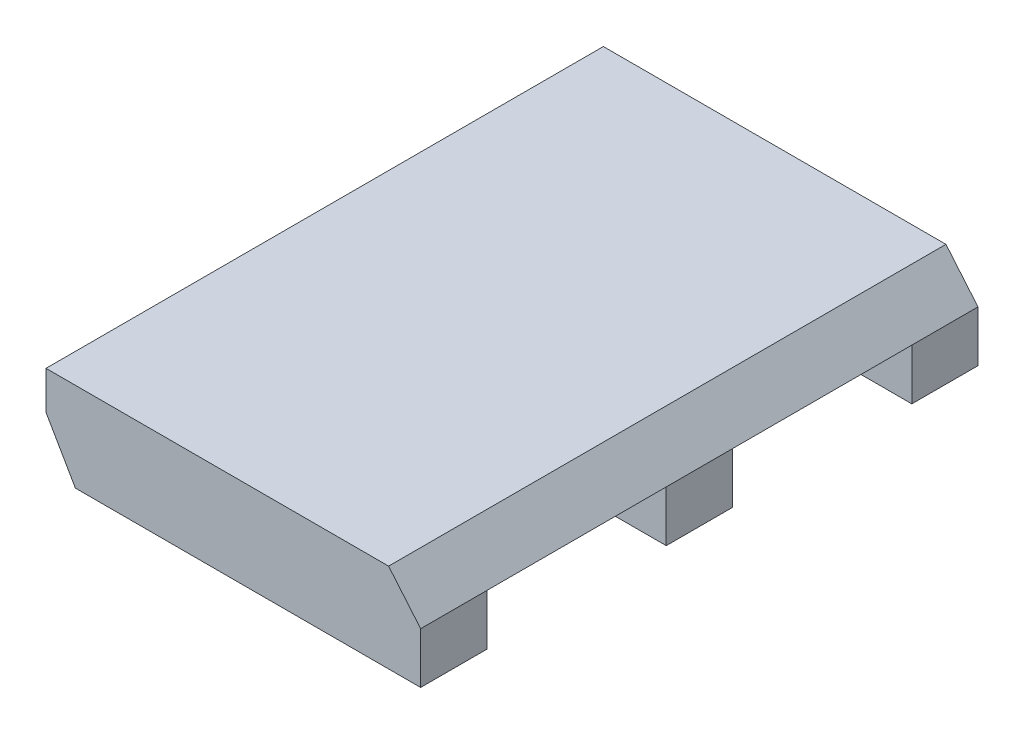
ISO-10303-21;
HEADER;
FILE_DESCRIPTION(('STEP AP214'),'2;1');
FILE_NAME('part.step','',(''),(''),'','','');
FILE_SCHEMA(('AUTOMOTIVE_DESIGN { 1 0 10303 214 1 1 1 1 }'));
ENDSEC;
DATA;
#1=APPLICATION_CONTEXT('core data for automotive mechanical design processes');
#2=APPLICATION_PROTOCOL_DEFINITION('international standard','automotive_design',2000,#1);
#3=PRODUCT_CONTEXT('',#1,'mechanical');
#4=PRODUCT('Part','Part','',(#3));
#5=PRODUCT_RELATED_PRODUCT_CATEGORY('part','',(#4));
#6=PRODUCT_DEFINITION_FORMATION('','',#4);
#7=PRODUCT_DEFINITION_CONTEXT('part definition',#1,'design');
#8=PRODUCT_DEFINITION('design','',#6,#7);
#9=PRODUCT_DEFINITION_SHAPE('','',#8);
#10=(LENGTH_UNIT() NAMED_UNIT(*) SI_UNIT(.MILLI.,.METRE.));
#11=(NAMED_UNIT(*) PLANE_ANGLE_UNIT() SI_UNIT($,.RADIAN.));
#12=(NAMED_UNIT(*) SI_UNIT($,.STERADIAN.) SOLID_ANGLE_UNIT());
#13=UNCERTAINTY_MEASURE_WITH_UNIT(LENGTH_MEASURE(1.E-05),#10,'distance_accuracy_value','');
#14=(GEOMETRIC_REPRESENTATION_CONTEXT(3) GLOBAL_UNCERTAINTY_ASSIGNED_CONTEXT((#13)) GLOBAL_UNIT_ASSIGNED_CONTEXT((#10,
#11,#12)) REPRESENTATION_CONTEXT('',''));
#15=CARTESIAN_POINT('',(0.,0.,0.));
#16=DIRECTION('',(0.,0.,1.));
#17=DIRECTION('',(1.,0.,0.));
#18=AXIS2_PLACEMENT_3D('',#15,#16,#17);
#19=CARTESIAN_POINT('',(0.,-1.5,21.9));
#20=DIRECTION('',(0.,1.,0.));
#21=DIRECTION('',(-1.,0.,0.));
#22=AXIS2_PLACEMENT_3D('',#19,#20,#21);
#23=PLANE('',#22);
#24=DIRECTION('',(0.,0.,-1.));
#25=VECTOR('',#24,1.);
#26=CARTESIAN_POINT('',(0.,-1.5,21.9));
#27=LINE('',#26,#25);
#28=CARTESIAN_POINT('',(0.,-1.5,9.65));
#29=VERTEX_POINT('',#28);
#30=CARTESIAN_POINT('',(0.,-1.5,2.6));
#31=VERTEX_POINT('',#30);
#32=EDGE_CURVE('E38',#29,#31,#27,.T.);
#33=ORIENTED_EDGE('',*,*,#32,.T.);
#34=DIRECTION('',(-1.,0.,0.));
#35=VECTOR('',#34,1.);
#36=CARTESIAN_POINT('',(0.,-1.5,2.6));
#37=LINE('',#36,#35);
#38=CARTESIAN_POINT('',(14.72,-1.5,2.6));
#39=VERTEX_POINT('',#38);
#40=EDGE_CURVE('E59',#39,#31,#37,.T.);
#41=ORIENTED_EDGE('',*,*,#40,.F.);
#42=DIRECTION('',(0.,0.,-1.));
#43=VECTOR('',#42,1.);
#44=CARTESIAN_POINT('',(14.72,-1.5,21.9));
#45=LINE('',#44,#43);
#46=CARTESIAN_POINT('',(14.72,-1.5,9.65));
#47=VERTEX_POINT('',#46);
#48=EDGE_CURVE('E158',#47,#39,#45,.T.);
#49=ORIENTED_EDGE('',*,*,#48,.F.);
#50=DIRECTION('',(-1.,0.,0.));
#51=VECTOR('',#50,1.);
#52=CARTESIAN_POINT('',(0.,-1.5,9.65));
#53=LINE('',#52,#51);
#54=EDGE_CURVE('E188',#47,#29,#53,.T.);
#55=ORIENTED_EDGE('',*,*,#54,.T.);
#56=EDGE_LOOP('',(#33,#41,#49,#55));
#57=FACE_BOUND('',#56,.T.);
#58=ADVANCED_FACE('F34',(#57),#23,.F.);
#59=CARTESIAN_POINT('',(0.,0.,21.9));
#60=DIRECTION('',(1.,0.,0.));
#61=DIRECTION('',(0.,1.,0.));
#62=AXIS2_PLACEMENT_3D('',#59,#60,#61);
#63=PLANE('',#62);
#64=DIRECTION('',(0.,-1.,0.));
#65=VECTOR('',#64,1.);
#66=CARTESIAN_POINT('',(0.,0.,0.));
#67=LINE('',#66,#65);
#68=CARTESIAN_POINT('',(0.,0.,0.));
#69=VERTEX_POINT('',#68);
#70=CARTESIAN_POINT('',(0.,-1.5,0.));
#71=VERTEX_POINT('',#70);
#72=EDGE_CURVE('E152',#69,#71,#67,.T.);
#73=ORIENTED_EDGE('',*,*,#72,.T.);
#74=DIRECTION('',(0.,0.,1.));
#75=VECTOR('',#74,1.);
#76=CARTESIAN_POINT('',(0.,-1.5,0.));
#77=LINE('',#76,#75);
#78=EDGE_CURVE('E52',#71,#31,#77,.T.);
#79=ORIENTED_EDGE('',*,*,#78,.T.);
#80=ORIENTED_EDGE('',*,*,#32,.F.);
#81=DIRECTION('',(0.,0.,1.));
#82=VECTOR('',#81,1.);
#83=CARTESIAN_POINT('',(0.,-1.5,9.65));
#84=LINE('',#83,#82);
#85=CARTESIAN_POINT('',(0.,-1.5,12.25));
#86=VERTEX_POINT('',#85);
#87=EDGE_CURVE('E214',#29,#86,#84,.T.);
#88=ORIENTED_EDGE('',*,*,#87,.T.);
#89=CARTESIAN_POINT('',(0.,-1.5,19.3));
#90=VERTEX_POINT('',#89);
#91=EDGE_CURVE('E44',#90,#86,#27,.T.);
#92=ORIENTED_EDGE('',*,*,#91,.F.);
#93=CARTESIAN_POINT('',(0.,-1.5,21.9));
#94=VERTEX_POINT('',#93);
#95=EDGE_CURVE('E11',#94,#90,#27,.T.);
#96=ORIENTED_EDGE('',*,*,#95,.F.);
#97=DIRECTION('',(0.,-1.,0.));
#98=VECTOR('',#97,1.);
#99=CARTESIAN_POINT('',(0.,0.,21.9));
#100=LINE('',#99,#98);
#101=CARTESIAN_POINT('',(0.,0.,21.9));
#102=VERTEX_POINT('',#101);
#103=EDGE_CURVE('E273',#102,#94,#100,.T.);
#104=ORIENTED_EDGE('',*,*,#103,.F.);
#105=DIRECTION('',(0.,0.,-1.));
#106=VECTOR('',#105,1.);
#107=CARTESIAN_POINT('',(0.,0.,21.9));
#108=LINE('',#107,#106);
#109=EDGE_CURVE('E274',#102,#69,#108,.T.);
#110=ORIENTED_EDGE('',*,*,#109,.T.);
#111=EDGE_LOOP('',(#73,#79,#80,#88,#92,#96,#104,#110));
#112=FACE_BOUND('',#111,.T.);
#113=ADVANCED_FACE('F36',(#112),#63,.F.);
#114=ORIENTED_EDGE('',*,*,#91,.T.);
#115=DIRECTION('',(-1.,0.,0.));
#116=VECTOR('',#115,1.);
#117=CARTESIAN_POINT('',(0.,-1.5,12.25));
#118=LINE('',#117,#116);
#119=CARTESIAN_POINT('',(14.72,-1.5,12.25));
#120=VERTEX_POINT('',#119);
#121=EDGE_CURVE('E201',#120,#86,#118,.T.);
#122=ORIENTED_EDGE('',*,*,#121,.F.);
#123=CARTESIAN_POINT('',(14.72,-1.5,19.3));
#124=VERTEX_POINT('',#123);
#125=EDGE_CURVE('E238',#124,#120,#45,.T.);
#126=ORIENTED_EDGE('',*,*,#125,.F.);
#127=DIRECTION('',(-1.,0.,0.));
#128=VECTOR('',#127,1.);
#129=CARTESIAN_POINT('',(0.,-1.5,19.3));
#130=LINE('',#129,#128);
#131=EDGE_CURVE('E223',#124,#90,#130,.T.);
#132=ORIENTED_EDGE('',*,*,#131,.T.);
#133=EDGE_LOOP('',(#114,#122,#126,#132));
#134=FACE_BOUND('',#133,.T.);
#135=ADVANCED_FACE('F308',(#134),#23,.F.);
#136=CARTESIAN_POINT('',(13.4613505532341,0.,21.9));
#137=DIRECTION('',(-0.766044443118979,-0.642787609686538,0.));
#138=DIRECTION('',(0.642787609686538,-0.766044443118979,0.));
#139=AXIS2_PLACEMENT_3D('',#136,#137,#138);
#140=PLANE('',#139);
#141=DIRECTION('',(-0.642787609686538,0.766044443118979,0.));
#142=VECTOR('',#141,1.);
#143=CARTESIAN_POINT('',(13.4613505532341,0.,0.));
#144=LINE('',#143,#142);
#145=CARTESIAN_POINT('',(14.72,-1.5,0.));
#146=VERTEX_POINT('',#145);
#147=CARTESIAN_POINT('',(13.4613505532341,0.,0.));
#148=VERTEX_POINT('',#147);
#149=EDGE_CURVE('E140',#146,#148,#144,.T.);
#150=ORIENTED_EDGE('',*,*,#149,.T.);
#151=DIRECTION('',(0.,0.,-1.));
#152=VECTOR('',#151,1.);
#153=CARTESIAN_POINT('',(13.4613505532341,0.,21.9));
#154=LINE('',#153,#152);
#155=CARTESIAN_POINT('',(13.4613505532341,0.,21.9));
#156=VERTEX_POINT('',#155);
#157=EDGE_CURVE('E239',#156,#148,#154,.T.);
#158=ORIENTED_EDGE('',*,*,#157,.F.);
#159=DIRECTION('',(-0.642787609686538,0.766044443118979,0.));
#160=VECTOR('',#159,1.);
#161=CARTESIAN_POINT('',(13.4613505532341,0.,21.9));
#162=LINE('',#161,#160);
#163=CARTESIAN_POINT('',(14.72,-1.5,21.9));
#164=VERTEX_POINT('',#163);
#165=EDGE_CURVE('E277',#164,#156,#162,.T.);
#166=ORIENTED_EDGE('',*,*,#165,.F.);
#167=EDGE_CURVE('E248',#164,#124,#45,.T.);
#168=ORIENTED_EDGE('',*,*,#167,.T.);
#169=ORIENTED_EDGE('',*,*,#125,.T.);
#170=DIRECTION('',(0.,0.,1.));
#171=VECTOR('',#170,1.);
#172=CARTESIAN_POINT('',(14.72,-1.5,9.65));
#173=LINE('',#172,#171);
#174=EDGE_CURVE('E198',#47,#120,#173,.T.);
#175=ORIENTED_EDGE('',*,*,#174,.F.);
#176=ORIENTED_EDGE('',*,*,#48,.T.);
#177=DIRECTION('',(0.,0.,1.));
#178=VECTOR('',#177,1.);
#179=CARTESIAN_POINT('',(14.72,-1.5,0.));
#180=LINE('',#179,#178);
#181=EDGE_CURVE('E155',#146,#39,#180,.T.);
#182=ORIENTED_EDGE('',*,*,#181,.F.);
#183=EDGE_LOOP('',(#150,#158,#166,#168,#169,#175,#176,#182));
#184=FACE_BOUND('',#183,.T.);
#185=ADVANCED_FACE('F156',(#184),#140,.F.);
#186=CARTESIAN_POINT('',(0.,0.,21.9));
#187=DIRECTION('',(0.,-1.,0.));
#188=DIRECTION('',(0.,0.,-1.));
#189=AXIS2_PLACEMENT_3D('',#186,#187,#188);
#190=PLANE('',#189);
#191=DIRECTION('',(-1.,0.,0.));
#192=VECTOR('',#191,1.);
#193=CARTESIAN_POINT('',(0.,0.,0.));
#194=LINE('',#193,#192);
#195=EDGE_CURVE('E148',#148,#69,#194,.T.);
#196=ORIENTED_EDGE('',*,*,#195,.T.);
#197=ORIENTED_EDGE('',*,*,#109,.F.);
#198=DIRECTION('',(-1.,0.,0.));
#199=VECTOR('',#198,1.);
#200=CARTESIAN_POINT('',(0.,0.,21.9));
#201=LINE('',#200,#199);
#202=EDGE_CURVE('E270',#156,#102,#201,.T.);
#203=ORIENTED_EDGE('',*,*,#202,.F.);
#204=ORIENTED_EDGE('',*,*,#157,.T.);
#205=EDGE_LOOP('',(#196,#197,#203,#204));
#206=FACE_BOUND('',#205,.T.);
#207=ADVANCED_FACE('F296',(#206),#190,.F.);
#208=CARTESIAN_POINT('',(0.,-1.5,21.9));
#209=DIRECTION('',(0.,0.,1.));
#210=DIRECTION('',(1.,0.,0.));
#211=AXIS2_PLACEMENT_3D('',#208,#209,#210);
#212=PLANE('',#211);
#213=ORIENTED_EDGE('',*,*,#103,.T.);
#214=DIRECTION('',(0.499999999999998,-0.86602540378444,0.));
#215=VECTOR('',#214,1.);
#216=CARTESIAN_POINT('',(0.,-1.5,21.9));
#217=LINE('',#216,#215);
#218=CARTESIAN_POINT('',(1.15470053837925,-3.5,21.9));
#219=VERTEX_POINT('',#218);
#220=EDGE_CURVE('E288',#94,#219,#217,.T.);
#221=ORIENTED_EDGE('',*,*,#220,.T.);
#222=DIRECTION('',(1.,0.,0.));
#223=VECTOR('',#222,1.);
#224=CARTESIAN_POINT('',(1.15470053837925,-3.5,21.9));
#225=LINE('',#224,#223);
#226=CARTESIAN_POINT('',(14.72,-3.5,21.9));
#227=VERTEX_POINT('',#226);
#228=EDGE_CURVE('E235',#219,#227,#225,.T.);
#229=ORIENTED_EDGE('',*,*,#228,.T.);
#230=DIRECTION('',(0.,1.,0.));
#231=VECTOR('',#230,1.);
#232=CARTESIAN_POINT('',(14.72,-1.5,21.9));
#233=LINE('',#232,#231);
#234=EDGE_CURVE('E211',#227,#164,#233,.T.);
#235=ORIENTED_EDGE('',*,*,#234,.T.);
#236=ORIENTED_EDGE('',*,*,#165,.T.);
#237=ORIENTED_EDGE('',*,*,#202,.T.);
#238=EDGE_LOOP('',(#213,#221,#229,#235,#236,#237));
#239=FACE_BOUND('',#238,.T.);
#240=ADVANCED_FACE('F291',(#239),#212,.T.);
#241=CARTESIAN_POINT('',(0.,-1.5,0.));
#242=DIRECTION('',(0.,0.,1.));
#243=DIRECTION('',(1.,0.,0.));
#244=AXIS2_PLACEMENT_3D('',#241,#242,#243);
#245=PLANE('',#244);
#246=ORIENTED_EDGE('',*,*,#72,.F.);
#247=ORIENTED_EDGE('',*,*,#195,.F.);
#248=ORIENTED_EDGE('',*,*,#149,.F.);
#249=DIRECTION('',(0.,1.,0.));
#250=VECTOR('',#249,1.);
#251=CARTESIAN_POINT('',(14.72,-1.5,0.));
#252=LINE('',#251,#250);
#253=CARTESIAN_POINT('',(14.72,-3.5,0.));
#254=VERTEX_POINT('',#253);
#255=EDGE_CURVE('E146',#254,#146,#252,.T.);
#256=ORIENTED_EDGE('',*,*,#255,.F.);
#257=DIRECTION('',(1.,0.,0.));
#258=VECTOR('',#257,1.);
#259=CARTESIAN_POINT('',(1.15470053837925,-3.5,0.));
#260=LINE('',#259,#258);
#261=CARTESIAN_POINT('',(1.15470053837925,-3.5,0.));
#262=VERTEX_POINT('',#261);
#263=EDGE_CURVE('E162',#262,#254,#260,.T.);
#264=ORIENTED_EDGE('',*,*,#263,.F.);
#265=DIRECTION('',(0.499999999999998,-0.86602540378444,0.));
#266=VECTOR('',#265,1.);
#267=CARTESIAN_POINT('',(0.,-1.5,0.));
#268=LINE('',#267,#266);
#269=EDGE_CURVE('E166',#71,#262,#268,.T.);
#270=ORIENTED_EDGE('',*,*,#269,.F.);
#271=EDGE_LOOP('',(#246,#247,#248,#256,#264,#270));
#272=FACE_BOUND('',#271,.T.);
#273=ADVANCED_FACE('F143',(#272),#245,.F.);
#274=CARTESIAN_POINT('',(14.72,-1.5,19.3));
#275=DIRECTION('',(1.,0.,0.));
#276=DIRECTION('',(0.,0.,-1.));
#277=AXIS2_PLACEMENT_3D('',#274,#275,#276);
#278=PLANE('',#277);
#279=ORIENTED_EDGE('',*,*,#234,.F.);
#280=DIRECTION('',(0.,0.,1.));
#281=VECTOR('',#280,1.);
#282=CARTESIAN_POINT('',(14.72,-3.5,19.3));
#283=LINE('',#282,#281);
#284=CARTESIAN_POINT('',(14.72,-3.5,19.3));
#285=VERTEX_POINT('',#284);
#286=EDGE_CURVE('E265',#285,#227,#283,.T.);
#287=ORIENTED_EDGE('',*,*,#286,.F.);
#288=DIRECTION('',(0.,1.,0.));
#289=VECTOR('',#288,1.);
#290=CARTESIAN_POINT('',(14.72,-1.5,19.3));
#291=LINE('',#290,#289);
#292=EDGE_CURVE('E227',#285,#124,#291,.T.);
#293=ORIENTED_EDGE('',*,*,#292,.T.);
#294=ORIENTED_EDGE('',*,*,#167,.F.);
#295=EDGE_LOOP('',(#279,#287,#293,#294));
#296=FACE_BOUND('',#295,.T.);
#297=ADVANCED_FACE('F304',(#296),#278,.T.);
#298=CARTESIAN_POINT('',(1.15470053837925,-3.5,19.3));
#299=DIRECTION('',(0.,-1.,0.));
#300=DIRECTION('',(0.,0.,-1.));
#301=AXIS2_PLACEMENT_3D('',#298,#299,#300);
#302=PLANE('',#301);
#303=ORIENTED_EDGE('',*,*,#228,.F.);
#304=DIRECTION('',(0.,0.,1.));
#305=VECTOR('',#304,1.);
#306=CARTESIAN_POINT('',(1.15470053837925,-3.5,19.3));
#307=LINE('',#306,#305);
#308=CARTESIAN_POINT('',(1.15470053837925,-3.5,19.3));
#309=VERTEX_POINT('',#308);
#310=EDGE_CURVE('E267',#309,#219,#307,.T.);
#311=ORIENTED_EDGE('',*,*,#310,.F.);
#312=DIRECTION('',(1.,0.,0.));
#313=VECTOR('',#312,1.);
#314=CARTESIAN_POINT('',(1.15470053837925,-3.5,19.3));
#315=LINE('',#314,#313);
#316=EDGE_CURVE('E220',#309,#285,#315,.T.);
#317=ORIENTED_EDGE('',*,*,#316,.T.);
#318=ORIENTED_EDGE('',*,*,#286,.T.);
#319=EDGE_LOOP('',(#303,#311,#317,#318));
#320=FACE_BOUND('',#319,.T.);
#321=ADVANCED_FACE('F300',(#320),#302,.T.);
#322=CARTESIAN_POINT('',(0.,-1.5,19.3));
#323=DIRECTION('',(-0.86602540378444,-0.499999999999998,0.));
#324=DIRECTION('',(0.499999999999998,-0.86602540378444,0.));
#325=AXIS2_PLACEMENT_3D('',#322,#323,#324);
#326=PLANE('',#325);
#327=ORIENTED_EDGE('',*,*,#220,.F.);
#328=ORIENTED_EDGE('',*,*,#95,.T.);
#329=DIRECTION('',(0.499999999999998,-0.86602540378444,0.));
#330=VECTOR('',#329,1.);
#331=CARTESIAN_POINT('',(0.,-1.5,19.3));
#332=LINE('',#331,#330);
#333=EDGE_CURVE('E226',#90,#309,#332,.T.);
#334=ORIENTED_EDGE('',*,*,#333,.T.);
#335=ORIENTED_EDGE('',*,*,#310,.T.);
#336=EDGE_LOOP('',(#327,#328,#334,#335));
#337=FACE_BOUND('',#336,.T.);
#338=ADVANCED_FACE('F331',(#337),#326,.T.);
#339=CARTESIAN_POINT('',(14.72,-3.5,19.3));
#340=DIRECTION('',(0.,0.,1.));
#341=DIRECTION('',(1.,0.,0.));
#342=AXIS2_PLACEMENT_3D('',#339,#340,#341);
#343=PLANE('',#342);
#344=ORIENTED_EDGE('',*,*,#292,.F.);
#345=ORIENTED_EDGE('',*,*,#316,.F.);
#346=ORIENTED_EDGE('',*,*,#333,.F.);
#347=ORIENTED_EDGE('',*,*,#131,.F.);
#348=EDGE_LOOP('',(#344,#345,#346,#347));
#349=FACE_BOUND('',#348,.T.);
#350=ADVANCED_FACE('F307',(#349),#343,.F.);
#351=CARTESIAN_POINT('',(14.72,-1.5,9.65));
#352=DIRECTION('',(1.,0.,0.));
#353=DIRECTION('',(0.,0.,-1.));
#354=AXIS2_PLACEMENT_3D('',#351,#352,#353);
#355=PLANE('',#354);
#356=DIRECTION('',(0.,1.,0.));
#357=VECTOR('',#356,1.);
#358=CARTESIAN_POINT('',(14.72,-1.5,12.25));
#359=LINE('',#358,#357);
#360=CARTESIAN_POINT('',(14.72,-3.5,12.25));
#361=VERTEX_POINT('',#360);
#362=EDGE_CURVE('E182',#361,#120,#359,.T.);
#363=ORIENTED_EDGE('',*,*,#362,.F.);
#364=DIRECTION('',(0.,0.,1.));
#365=VECTOR('',#364,1.);
#366=CARTESIAN_POINT('',(14.72,-3.5,9.65));
#367=LINE('',#366,#365);
#368=CARTESIAN_POINT('',(14.72,-3.5,9.65));
#369=VERTEX_POINT('',#368);
#370=EDGE_CURVE('E209',#369,#361,#367,.T.);
#371=ORIENTED_EDGE('',*,*,#370,.F.);
#372=DIRECTION('',(0.,1.,0.));
#373=VECTOR('',#372,1.);
#374=CARTESIAN_POINT('',(14.72,-1.5,9.65));
#375=LINE('',#374,#373);
#376=EDGE_CURVE('E186',#369,#47,#375,.T.);
#377=ORIENTED_EDGE('',*,*,#376,.T.);
#378=ORIENTED_EDGE('',*,*,#174,.T.);
#379=EDGE_LOOP('',(#363,#371,#377,#378));
#380=FACE_BOUND('',#379,.T.);
#381=ADVANCED_FACE('F323',(#380),#355,.T.);
#382=CARTESIAN_POINT('',(1.15470053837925,-3.5,9.65));
#383=DIRECTION('',(0.,-1.,0.));
#384=DIRECTION('',(0.,0.,-1.));
#385=AXIS2_PLACEMENT_3D('',#382,#383,#384);
#386=PLANE('',#385);
#387=DIRECTION('',(1.,0.,0.));
#388=VECTOR('',#387,1.);
#389=CARTESIAN_POINT('',(1.15470053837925,-3.5,12.25));
#390=LINE('',#389,#388);
#391=CARTESIAN_POINT('',(1.15470053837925,-3.5,12.25));
#392=VERTEX_POINT('',#391);
#393=EDGE_CURVE('E189',#392,#361,#390,.T.);
#394=ORIENTED_EDGE('',*,*,#393,.F.);
#395=DIRECTION('',(0.,0.,1.));
#396=VECTOR('',#395,1.);
#397=CARTESIAN_POINT('',(1.15470053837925,-3.5,9.65));
#398=LINE('',#397,#396);
#399=CARTESIAN_POINT('',(1.15470053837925,-3.5,9.65));
#400=VERTEX_POINT('',#399);
#401=EDGE_CURVE('E212',#400,#392,#398,.T.);
#402=ORIENTED_EDGE('',*,*,#401,.F.);
#403=DIRECTION('',(1.,0.,0.));
#404=VECTOR('',#403,1.);
#405=CARTESIAN_POINT('',(1.15470053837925,-3.5,9.65));
#406=LINE('',#405,#404);
#407=EDGE_CURVE('E195',#400,#369,#406,.T.);
#408=ORIENTED_EDGE('',*,*,#407,.T.);
#409=ORIENTED_EDGE('',*,*,#370,.T.);
#410=EDGE_LOOP('',(#394,#402,#408,#409));
#411=FACE_BOUND('',#410,.T.);
#412=ADVANCED_FACE('F318',(#411),#386,.T.);
#413=CARTESIAN_POINT('',(0.,-1.5,9.65));
#414=DIRECTION('',(-0.86602540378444,-0.499999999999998,0.));
#415=DIRECTION('',(0.499999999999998,-0.86602540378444,0.));
#416=AXIS2_PLACEMENT_3D('',#413,#414,#415);
#417=PLANE('',#416);
#418=DIRECTION('',(0.499999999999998,-0.86602540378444,0.));
#419=VECTOR('',#418,1.);
#420=CARTESIAN_POINT('',(0.,-1.5,12.25));
#421=LINE('',#420,#419);
#422=EDGE_CURVE('E204',#86,#392,#421,.T.);
#423=ORIENTED_EDGE('',*,*,#422,.F.);
#424=ORIENTED_EDGE('',*,*,#87,.F.);
#425=DIRECTION('',(0.499999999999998,-0.86602540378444,0.));
#426=VECTOR('',#425,1.);
#427=CARTESIAN_POINT('',(0.,-1.5,9.65));
#428=LINE('',#427,#426);
#429=EDGE_CURVE('E192',#29,#400,#428,.T.);
#430=ORIENTED_EDGE('',*,*,#429,.T.);
#431=ORIENTED_EDGE('',*,*,#401,.T.);
#432=EDGE_LOOP('',(#423,#424,#430,#431));
#433=FACE_BOUND('',#432,.T.);
#434=ADVANCED_FACE('F311',(#433),#417,.T.);
#435=CARTESIAN_POINT('',(14.72,-3.5,9.65));
#436=DIRECTION('',(0.,0.,1.));
#437=DIRECTION('',(1.,0.,0.));
#438=AXIS2_PLACEMENT_3D('',#435,#436,#437);
#439=PLANE('',#438);
#440=ORIENTED_EDGE('',*,*,#376,.F.);
#441=ORIENTED_EDGE('',*,*,#407,.F.);
#442=ORIENTED_EDGE('',*,*,#429,.F.);
#443=ORIENTED_EDGE('',*,*,#54,.F.);
#444=EDGE_LOOP('',(#440,#441,#442,#443));
#445=FACE_BOUND('',#444,.T.);
#446=ADVANCED_FACE('F315',(#445),#439,.F.);
#447=CARTESIAN_POINT('',(14.72,-3.5,12.25));
#448=DIRECTION('',(0.,0.,1.));
#449=DIRECTION('',(1.,0.,0.));
#450=AXIS2_PLACEMENT_3D('',#447,#448,#449);
#451=PLANE('',#450);
#452=ORIENTED_EDGE('',*,*,#362,.T.);
#453=ORIENTED_EDGE('',*,*,#121,.T.);
#454=ORIENTED_EDGE('',*,*,#422,.T.);
#455=ORIENTED_EDGE('',*,*,#393,.T.);
#456=EDGE_LOOP('',(#452,#453,#454,#455));
#457=FACE_BOUND('',#456,.T.);
#458=ADVANCED_FACE('F321',(#457),#451,.T.);
#459=CARTESIAN_POINT('',(14.72,-1.5,0.));
#460=DIRECTION('',(1.,0.,0.));
#461=DIRECTION('',(0.,0.,-1.));
#462=AXIS2_PLACEMENT_3D('',#459,#460,#461);
#463=PLANE('',#462);
#464=DIRECTION('',(0.,1.,0.));
#465=VECTOR('',#464,1.);
#466=CARTESIAN_POINT('',(14.72,-1.5,2.6));
#467=LINE('',#466,#465);
#468=CARTESIAN_POINT('',(14.72,-3.5,2.6));
#469=VERTEX_POINT('',#468);
#470=EDGE_CURVE('E176',#469,#39,#467,.T.);
#471=ORIENTED_EDGE('',*,*,#470,.F.);
#472=DIRECTION('',(0.,0.,1.));
#473=VECTOR('',#472,1.);
#474=CARTESIAN_POINT('',(14.72,-3.5,0.));
#475=LINE('',#474,#473);
#476=EDGE_CURVE('E165',#254,#469,#475,.T.);
#477=ORIENTED_EDGE('',*,*,#476,.F.);
#478=ORIENTED_EDGE('',*,*,#255,.T.);
#479=ORIENTED_EDGE('',*,*,#181,.T.);
#480=EDGE_LOOP('',(#471,#477,#478,#479));
#481=FACE_BOUND('',#480,.T.);
#482=ADVANCED_FACE('F164',(#481),#463,.T.);
#483=CARTESIAN_POINT('',(1.15470053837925,-3.5,0.));
#484=DIRECTION('',(0.,-1.,0.));
#485=DIRECTION('',(0.,0.,-1.));
#486=AXIS2_PLACEMENT_3D('',#483,#484,#485);
#487=PLANE('',#486);
#488=DIRECTION('',(1.,0.,0.));
#489=VECTOR('',#488,1.);
#490=CARTESIAN_POINT('',(1.15470053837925,-3.5,2.6));
#491=LINE('',#490,#489);
#492=CARTESIAN_POINT('',(1.15470053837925,-3.5,2.6));
#493=VERTEX_POINT('',#492);
#494=EDGE_CURVE('E167',#493,#469,#491,.T.);
#495=ORIENTED_EDGE('',*,*,#494,.F.);
#496=DIRECTION('',(0.,0.,1.));
#497=VECTOR('',#496,1.);
#498=CARTESIAN_POINT('',(1.15470053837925,-3.5,0.));
#499=LINE('',#498,#497);
#500=EDGE_CURVE('E183',#262,#493,#499,.T.);
#501=ORIENTED_EDGE('',*,*,#500,.F.);
#502=ORIENTED_EDGE('',*,*,#263,.T.);
#503=ORIENTED_EDGE('',*,*,#476,.T.);
#504=EDGE_LOOP('',(#495,#501,#502,#503));
#505=FACE_BOUND('',#504,.T.);
#506=ADVANCED_FACE('F263',(#505),#487,.T.);
#507=CARTESIAN_POINT('',(0.,-1.5,0.));
#508=DIRECTION('',(-0.86602540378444,-0.499999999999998,0.));
#509=DIRECTION('',(0.499999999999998,-0.86602540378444,0.));
#510=AXIS2_PLACEMENT_3D('',#507,#508,#509);
#511=PLANE('',#510);
#512=DIRECTION('',(0.499999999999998,-0.86602540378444,0.));
#513=VECTOR('',#512,1.);
#514=CARTESIAN_POINT('',(0.,-1.5,2.6));
#515=LINE('',#514,#513);
#516=EDGE_CURVE('E172',#31,#493,#515,.T.);
#517=ORIENTED_EDGE('',*,*,#516,.F.);
#518=ORIENTED_EDGE('',*,*,#78,.F.);
#519=ORIENTED_EDGE('',*,*,#269,.T.);
#520=ORIENTED_EDGE('',*,*,#500,.T.);
#521=EDGE_LOOP('',(#517,#518,#519,#520));
#522=FACE_BOUND('',#521,.T.);
#523=ADVANCED_FACE('F257',(#522),#511,.T.);
#524=CARTESIAN_POINT('',(14.72,-3.5,2.6));
#525=DIRECTION('',(0.,0.,1.));
#526=DIRECTION('',(1.,0.,0.));
#527=AXIS2_PLACEMENT_3D('',#524,#525,#526);
#528=PLANE('',#527);
#529=ORIENTED_EDGE('',*,*,#470,.T.);
#530=ORIENTED_EDGE('',*,*,#40,.T.);
#531=ORIENTED_EDGE('',*,*,#516,.T.);
#532=ORIENTED_EDGE('',*,*,#494,.T.);
#533=EDGE_LOOP('',(#529,#530,#531,#532));
#534=FACE_BOUND('',#533,.T.);
#535=ADVANCED_FACE('F261',(#534),#528,.T.);
#536=CLOSED_SHELL('',(#58,#113,#135,#185,#207,#240,#273,#297,#321,#338,#350,#381,#412,#434,#446,
#458,#482,#506,#523,#535));
#537=MANIFOLD_SOLID_BREP('B2',#536);
#538=ADVANCED_BREP_SHAPE_REPRESENTATION('',(#18,#537),#14);
#539=SHAPE_DEFINITION_REPRESENTATION(#9,#538);
ENDSEC;
END-ISO-10303-21;
